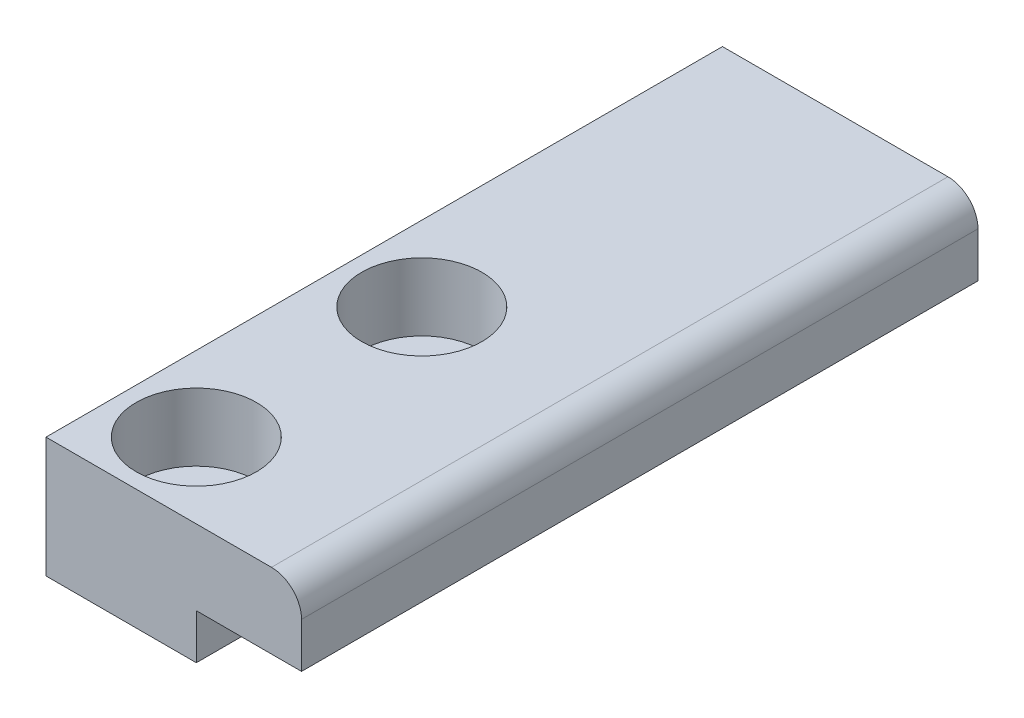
from build123d import *

# Parameters (mm, degrees)
EXTRUDE_1_DEPTH     = 45
SKETCH_2_R          = 2.25
CUT_EXTRUDE_1_DEPTH = 45
SKETCH_3_R          = 4
CUT_EXTRUDE_2_DEPTH = 4.5


with BuildPart() as part:
    # Sketch 1 → Extrude 1 (new body)
    with BuildSketch(Plane.XY):
        with BuildLine():
            Line((0, 0), (0, 8))
            Line((0, 8), (15, 8))
            ThreePointArc((15, 8), (16.414213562, 7.414213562), (17, 6))
            Line((17, 6), (17, 3))
            Line((17, 3), (10, 3))
            Line((10, 3), (10, 0))
            Line((10, 0), (0, 0))
        make_face()
    extrude(amount=EXTRUDE_1_DEPTH)

    # Sketch 2 → Cut-Extrude 1 (cut)
    with BuildSketch(Plane(origin=(0, 8, 0), x_dir=(1, 0, 0), z_dir=(0, 1, 0))):
        with Locations(Location((5, -40, 0), (0, 0, 270))):
            Circle(SKETCH_2_R)
        with Locations(Location((5, -25, 0), (0, 0, 270))):
            Circle(SKETCH_2_R)
    extrude(amount=-CUT_EXTRUDE_1_DEPTH, mode=Mode.SUBTRACT)

    # Sketch 3 → Cut-Extrude 2 (cut)
    with BuildSketch(Plane(origin=(0, 8, 0), x_dir=(1, 0, 0), z_dir=(0, 1, 0))):
        with Locations(Location((5, -40, 0), (0, 0, 270))):
            Circle(SKETCH_3_R)
        with Locations(Location((5, -25, 0), (0, 0, 270))):
            Circle(SKETCH_3_R)
    extrude(amount=-CUT_EXTRUDE_2_DEPTH, mode=Mode.SUBTRACT)


solid = part.part
